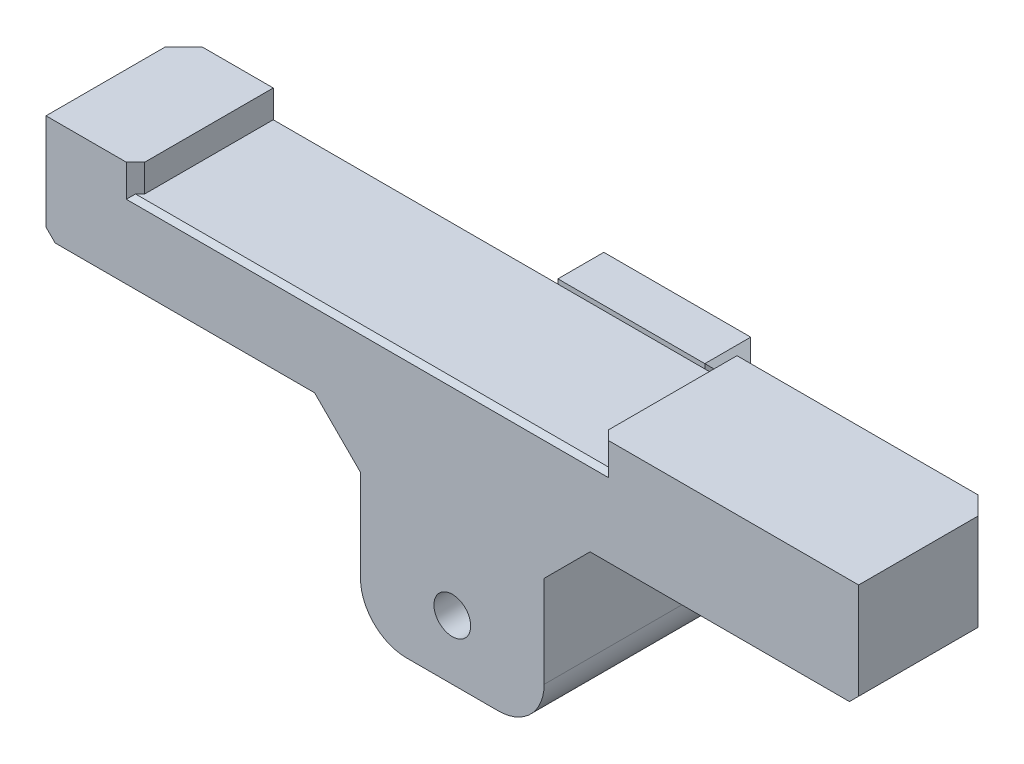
from build123d import *

# Parameters (mm, degrees)
SKIZZE1_W                                   = 177
SKIZZE1_H                                   = 23
AUFSATZ_LINEAR_AUSTRAGEN1_DEPTH             = 30
SKIZZE3_W                                   = 20
SKIZZE3_H                                   = 40
AUFSATZ_LINEAR_AUSTRAGEN2_DEPTH             = 19
AUFSATZ_LINEAR_AUSTRAGEN2_DIRECTION_2_REACH = 96.151
SKIZZE4_W                                   = 40
SKIZZE4_H                                   = 10
AUFSATZ_LINEAR_AUSTRAGEN3_DEPTH             = 9
FASE1_SIZE                                  = 10
FASE2_SIZE                                  = 4
SCHNITT_LINEAR_AUSTRAGEN5_DEPTH             = 107.69817243
SCHNITT_LINEAR_AUSTRAGEN5_DEPTH_BACK        = 107.69817243
SKIZZE9_W                                   = 9
SKIZZE9_H                                   = 0.7
FASE3_SIZE                                  = 2
SCHNITT_LINEAR_START                        = -63
SKIZZE6_W                                   = 6.9
SKIZZE6_H                                   = 7
SCHNITT_LINEAR_AUSTRAGEN2_DEPTH             = 20
SKIZZE5_R                                   = 4
SCHNITT_LINEAR_AUSTRAGEN1_DEPTH             = 13
SCHNITT_LINEAR_AUSTRAGEN3_REACH             = 115.514
SKIZZE7_W                                   = 101
SKIZZE7_H                                   = 6
FASE4_SIZE                                  = 2
FASE5_SIZE                                  = 1
VERRUNDUNG1_R                               = 10


with BuildPart() as part:
    # Skizze1 → Aufsatz-Linear austragen1 (new body)
    with BuildSketch(Plane.XY):
        Rectangle(SKIZZE1_W, SKIZZE1_H)
    extrude(amount=AUFSATZ_LINEAR_AUSTRAGEN1_DEPTH)

    # Skizze3 → Aufsatz-Linear austragen2 (add)
    with BuildSketch(Plane(origin=(0, 0, 0), x_dir=(-1, 0, 0), z_dir=(0, 0, -1))):
        with Locations((-10, -31.5)):
            Rectangle(SKIZZE3_W, SKIZZE3_H)
        with Locations((10, -31.5)):
            Rectangle(SKIZZE3_W, SKIZZE3_H)
    extrude(amount=AUFSATZ_LINEAR_AUSTRAGEN2_DEPTH)

    # Aufsatz-Linear austragen2 direction 2: up to this face of the body (flat: up to its plane)
    aufsatz_linear_austragen2_direction_2_end = Plane(part.part.faces().sort_by_distance((0, 0, 30))[0])
    # Skizze3 → Aufsatz-Linear austragen2 direction 2 (add, up to the picked face)
    with BuildSketch(Plane(origin=(0, 0, 0), x_dir=(-1, 0, 0), z_dir=(0, 0, -1)), mode=Mode.PRIVATE) as aufsatz_linear_austragen2_direction_2_sk1:
        with Locations((-10, -31.5)):
            Rectangle(SKIZZE3_W, SKIZZE3_H)
    aufsatz_linear_austragen2_direction_2_tool1 = split(extrude(aufsatz_linear_austragen2_direction_2_sk1.sketch, amount=-AUFSATZ_LINEAR_AUSTRAGEN2_DIRECTION_2_REACH, mode=Mode.PRIVATE), bisect_by=aufsatz_linear_austragen2_direction_2_end, keep=Keep.BOTH, mode=Mode.PRIVATE)
    # Skizze3 → Aufsatz-Linear austragen2 direction 2 (add, up to the picked face)
    with BuildSketch(Plane(origin=(0, 0, 0), x_dir=(-1, 0, 0), z_dir=(0, 0, -1)), mode=Mode.PRIVATE) as aufsatz_linear_austragen2_direction_2_sk2:
        with Locations((10, -31.5)):
            Rectangle(SKIZZE3_W, SKIZZE3_H)
    aufsatz_linear_austragen2_direction_2_tool2 = split(extrude(aufsatz_linear_austragen2_direction_2_sk2.sketch, amount=-AUFSATZ_LINEAR_AUSTRAGEN2_DIRECTION_2_REACH, mode=Mode.PRIVATE), bisect_by=aufsatz_linear_austragen2_direction_2_end, keep=Keep.BOTH, mode=Mode.PRIVATE)
    add(aufsatz_linear_austragen2_direction_2_tool1.solids().sort_by(Axis((10, -31.5, 0), (0, 0, 1)))[0])
    add(aufsatz_linear_austragen2_direction_2_tool2.solids().sort_by(Axis((-10, -31.5, 0), (0, 0, 1)))[0])

    # Skizze4 → Aufsatz-Linear austragen3 (add)
    with BuildSketch(Plane(origin=(0, -11.5, 0), x_dir=(1, 0, 0), z_dir=(0, 1, 0))):
        with Locations((0, 14)):
            Rectangle(SKIZZE4_W, SKIZZE4_H)
    extrude(amount=AUFSATZ_LINEAR_AUSTRAGEN3_DEPTH)

    # Fase1
    fase1_edges = [part.edges().sort_by_distance(p)[0] for p in [
        (20, -11.5, 15),
        (-20, -11.5, 15),
    ]]
    chamfer(fase1_edges, length=FASE1_SIZE)

    # Fase2
    fase2_edges = [part.edges().sort_by_distance(p)[0] for p in [
        (20, -11.5, -4.5),
        (20, -27, -19),
        (-20, -11.5, -4.5),
        (-20, -27, -19),
        (20, -7, -9),
        (-20, -7, -9),
        (20, -2.5, -14),
        (-20, -2.5, -14),
        (-88.5, 0, 0),
        (88.5, 0, 0),
    ]]
    chamfer(fase2_edges, length=FASE2_SIZE)

    # Skizze9 → Schnitt-Linear austragen5 (cut, two sides: drawn at the far end of the back side and taken through both)
    with BuildSketch(Plane(origin=(0, 0, 0), x_dir=(0, 0, -1), z_dir=(1, 0, 0)).offset(-SCHNITT_LINEAR_AUSTRAGEN5_DEPTH_BACK)):
        with Locations((4.5, -11.85)):
            Rectangle(SKIZZE9_W, SKIZZE9_H)
    extrude(amount=SCHNITT_LINEAR_AUSTRAGEN5_DEPTH + SCHNITT_LINEAR_AUSTRAGEN5_DEPTH_BACK, mode=Mode.SUBTRACT)

    # Fase3
    fase3_edges = [part.edges().sort_by_distance(p)[0] for p in [
        (88.5, -11.5, 17),
        (-88.5, -11.5, 17),
    ]]
    chamfer(fase3_edges, length=FASE3_SIZE)

    # Skizze6 → Schnitt-Linear austragen2 (cut)
    with BuildSketch(Plane(origin=(0, 11.5, 0), x_dir=(1, 0, 0), z_dir=(0, 1, 0)).offset(SCHNITT_LINEAR_START)):
        with Locations((-3.45, -20.5)):
            Rectangle(SKIZZE6_W, SKIZZE6_H)
        with Locations((3.45, -20.5)):
            Rectangle(SKIZZE6_W, SKIZZE6_H)
    extrude(amount=SCHNITT_LINEAR_AUSTRAGEN2_DEPTH, mode=Mode.SUBTRACT)

    # Skizze5 → Schnitt-Linear austragen1 (cut)
    with BuildSketch(Plane.XY.offset(30)):
        with Locations((0, -38.5)):
            Circle(SKIZZE5_R)
    extrude(amount=-SCHNITT_LINEAR_AUSTRAGEN1_DEPTH, mode=Mode.SUBTRACT)

    # Skizze7 → Schnitt-Linear austragen3 (cut, up to next)
    with BuildSketch(Plane.XY.offset(30), mode=Mode.PRIVATE) as schnitt_linear_austragen3_sk1:
        with Locations((-18.5, 8.5)):
            Rectangle(SKIZZE7_W, SKIZZE7_H)
    schnitt_linear_austragen3_tool1 = extrude(schnitt_linear_austragen3_sk1.sketch, amount=-SCHNITT_LINEAR_AUSTRAGEN3_REACH, mode=Mode.PRIVATE) & part.part
    add(schnitt_linear_austragen3_tool1.solids().sort_by_distance((-18.5, 8.5, 30))[0], mode=Mode.SUBTRACT)

    # Fase4
    fase4_edges = [part.edges().sort_by_distance(p)[0] for p in [
        (-69, 8.5, 30),
        (32, 8.5, 30),
    ]]
    chamfer(fase4_edges, length=FASE4_SIZE)

    # Fase5
    fase5_edges = [part.edges().sort_by_distance(p)[0] for p in [
        (-18.5, 5.5, 30),
    ]]
    chamfer(fase5_edges, length=FASE5_SIZE)

    # Verrundung1
    verrundung1_edges = [part.edges().sort_by_distance(p)[0] for p in [
        (-20, -51.5, 7.5),
        (20, -51.5, 7.5),
    ]]
    fillet(verrundung1_edges, radius=VERRUNDUNG1_R)


solid = part.part
